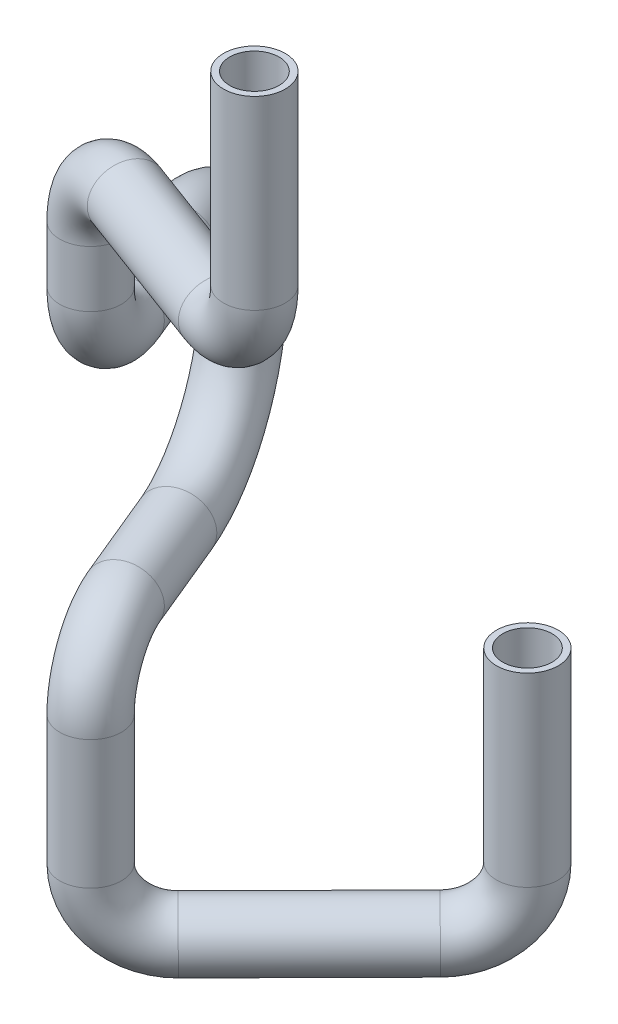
ISO-10303-21;
HEADER;
FILE_DESCRIPTION(('STEP AP214'),'2;1');
FILE_NAME('part.step','',(''),(''),'','','');
FILE_SCHEMA(('AUTOMOTIVE_DESIGN { 1 0 10303 214 1 1 1 1 }'));
ENDSEC;
DATA;
#1=APPLICATION_CONTEXT('core data for automotive mechanical design processes');
#2=APPLICATION_PROTOCOL_DEFINITION('international standard','automotive_design',2000,#1);
#3=PRODUCT_CONTEXT('',#1,'mechanical');
#4=PRODUCT('Part','Part','',(#3));
#5=PRODUCT_RELATED_PRODUCT_CATEGORY('part','',(#4));
#6=PRODUCT_DEFINITION_FORMATION('','',#4);
#7=PRODUCT_DEFINITION_CONTEXT('part definition',#1,'design');
#8=PRODUCT_DEFINITION('design','',#6,#7);
#9=PRODUCT_DEFINITION_SHAPE('','',#8);
#10=(LENGTH_UNIT() NAMED_UNIT(*) SI_UNIT(.MILLI.,.METRE.));
#11=(NAMED_UNIT(*) PLANE_ANGLE_UNIT() SI_UNIT($,.RADIAN.));
#12=(NAMED_UNIT(*) SI_UNIT($,.STERADIAN.) SOLID_ANGLE_UNIT());
#13=UNCERTAINTY_MEASURE_WITH_UNIT(LENGTH_MEASURE(1.E-05),#10,'distance_accuracy_value','');
#14=(GEOMETRIC_REPRESENTATION_CONTEXT(3) GLOBAL_UNCERTAINTY_ASSIGNED_CONTEXT((#13)) GLOBAL_UNIT_ASSIGNED_CONTEXT((#10,
#11,#12)) REPRESENTATION_CONTEXT('',''));
#15=CARTESIAN_POINT('',(0.,0.,0.));
#16=DIRECTION('',(0.,0.,1.));
#17=DIRECTION('',(1.,0.,0.));
#18=AXIS2_PLACEMENT_3D('',#15,#16,#17);
#19=CARTESIAN_POINT('',(-6.85989280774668,-139.849267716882,6.8598928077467));
#20=DIRECTION('',(0.,1.,0.));
#21=DIRECTION('',(0.,0.,1.));
#22=AXIS2_PLACEMENT_3D('',#19,#20,#21);
#23=CYLINDRICAL_SURFACE('',#22,5.);
#24=CARTESIAN_POINT('',(-6.85989280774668,-139.849267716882,6.8598928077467));
#25=DIRECTION('',(0.,-1.,0.));
#26=DIRECTION('',(1.,0.,0.));
#27=AXIS2_PLACEMENT_3D('',#24,#25,#26);
#28=CIRCLE('',#27,5.);
#29=CARTESIAN_POINT('',(-3.32435890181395,-139.849267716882,3.32435890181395));
#30=VERTEX_POINT('',#29);
#31=EDGE_CURVE('E41',#30,#30,#28,.T.);
#32=ORIENTED_EDGE('',*,*,#31,.F.);
#33=EDGE_LOOP('',(#32));
#34=FACE_BOUND('',#33,.T.);
#35=CARTESIAN_POINT('',(-6.85989280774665,-109.811672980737,6.85989280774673));
#36=DIRECTION('',(0.,-1.,0.));
#37=DIRECTION('',(1.,0.,0.));
#38=AXIS2_PLACEMENT_3D('',#35,#36,#37);
#39=CIRCLE('',#38,5.);
#40=CARTESIAN_POINT('',(-1.85989280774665,-109.811672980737,6.8598928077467));
#41=VERTEX_POINT('',#40);
#42=EDGE_CURVE('E10',#41,#41,#39,.T.);
#43=ORIENTED_EDGE('',*,*,#42,.T.);
#44=EDGE_LOOP('',(#43));
#45=FACE_BOUND('',#44,.T.);
#46=ADVANCED_FACE('F31',(#34,#45),#23,.T.);
#47=CARTESIAN_POINT('',(-6.85989280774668,-139.849267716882,6.8598928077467));
#48=DIRECTION('',(0.,1.,0.));
#49=DIRECTION('',(0.,0.,1.));
#50=AXIS2_PLACEMENT_3D('',#47,#48,#49);
#51=CYLINDRICAL_SURFACE('',#50,4.);
#52=CARTESIAN_POINT('',(-6.85989280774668,-139.849267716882,6.8598928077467));
#53=DIRECTION('',(0.,-1.,0.));
#54=DIRECTION('',(1.,0.,0.));
#55=AXIS2_PLACEMENT_3D('',#52,#53,#54);
#56=CIRCLE('',#55,4.);
#57=CARTESIAN_POINT('',(-4.03146568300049,-139.849267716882,4.03146568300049));
#58=VERTEX_POINT('',#57);
#59=EDGE_CURVE('E45',#58,#58,#56,.T.);
#60=ORIENTED_EDGE('',*,*,#59,.T.);
#61=EDGE_LOOP('',(#60));
#62=FACE_BOUND('',#61,.T.);
#63=CARTESIAN_POINT('',(-6.85989280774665,-109.811672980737,6.85989280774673));
#64=DIRECTION('',(0.,-1.,0.));
#65=DIRECTION('',(1.,0.,0.));
#66=AXIS2_PLACEMENT_3D('',#63,#64,#65);
#67=CIRCLE('',#66,4.);
#68=CARTESIAN_POINT('',(-2.85989280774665,-109.811672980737,6.8598928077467));
#69=VERTEX_POINT('',#68);
#70=EDGE_CURVE('E37',#69,#69,#67,.T.);
#71=ORIENTED_EDGE('',*,*,#70,.F.);
#72=EDGE_LOOP('',(#71));
#73=FACE_BOUND('',#72,.T.);
#74=ADVANCED_FACE('F160',(#62,#73),#51,.F.);
#75=CARTESIAN_POINT('',(-13.9309606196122,-139.849267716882,13.9309606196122));
#76=DIRECTION('',(0.707106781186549,0.,0.707106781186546));
#77=DIRECTION('',(0.707106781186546,0.,-0.707106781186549));
#78=AXIS2_PLACEMENT_3D('',#75,#76,#77);
#79=TOROIDAL_SURFACE('',#78,10.,5.);
#80=CARTESIAN_POINT('',(-13.9043271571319,-149.849196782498,13.904327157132));
#81=DIRECTION('',(-0.707101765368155,-0.00376654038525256,0.707101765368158));
#82=DIRECTION('',(0.501883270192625,-0.707101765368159,0.498116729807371));
#83=AXIS2_PLACEMENT_3D('',#80,#81,#82);
#84=CIRCLE('',#83,5.);
#85=CARTESIAN_POINT('',(-13.8910104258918,-154.849161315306,13.8910104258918));
#86=VERTEX_POINT('',#85);
#87=EDGE_CURVE('E50',#86,#86,#84,.T.);
#88=CARTESIAN_POINT('',(-13.9309606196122,-139.849267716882,13.9309606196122));
#89=DIRECTION('',(0.707106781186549,0.,0.707106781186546));
#90=DIRECTION('',(0.707106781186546,0.,-0.707106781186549));
#91=AXIS2_PLACEMENT_3D('',#88,#89,#90);
#92=CIRCLE('',#91,15.);
#93=EDGE_CURVE('',#86,#30,#92,.T.);
#94=ORIENTED_EDGE('',*,*,#87,.F.);
#95=ORIENTED_EDGE('',*,*,#31,.T.);
#96=ORIENTED_EDGE('',*,*,#93,.T.);
#97=ORIENTED_EDGE('',*,*,#93,.F.);
#98=EDGE_LOOP('',(#94,#96,#95,#97));
#99=FACE_BOUND('',#98,.T.);
#100=ADVANCED_FACE('F165',(#99),#79,.T.);
#101=CARTESIAN_POINT('',(-13.9309606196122,-139.849267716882,13.9309606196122));
#102=DIRECTION('',(0.707106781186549,0.,0.707106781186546));
#103=DIRECTION('',(0.707106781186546,0.,-0.707106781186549));
#104=AXIS2_PLACEMENT_3D('',#101,#102,#103);
#105=TOROIDAL_SURFACE('',#104,10.,4.);
#106=CARTESIAN_POINT('',(-13.9043271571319,-149.849196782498,13.904327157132));
#107=DIRECTION('',(-0.707101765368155,-0.00376654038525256,0.707101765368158));
#108=DIRECTION('',(0.501883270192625,-0.707101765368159,0.498116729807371));
#109=AXIS2_PLACEMENT_3D('',#106,#107,#108);
#110=CIRCLE('',#109,4.);
#111=CARTESIAN_POINT('',(-13.8936737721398,-153.849168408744,13.8936737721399));
#112=VERTEX_POINT('',#111);
#113=EDGE_CURVE('E53',#112,#112,#110,.T.);
#114=CARTESIAN_POINT('',(-13.9309606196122,-139.849267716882,13.9309606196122));
#115=DIRECTION('',(0.707106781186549,0.,0.707106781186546));
#116=DIRECTION('',(0.707106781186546,0.,-0.707106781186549));
#117=AXIS2_PLACEMENT_3D('',#114,#115,#116);
#118=CIRCLE('',#117,14.);
#119=EDGE_CURVE('',#112,#58,#118,.T.);
#120=ORIENTED_EDGE('',*,*,#113,.T.);
#121=ORIENTED_EDGE('',*,*,#59,.F.);
#122=ORIENTED_EDGE('',*,*,#119,.T.);
#123=ORIENTED_EDGE('',*,*,#119,.F.);
#124=EDGE_LOOP('',(#120,#122,#121,#123));
#125=FACE_BOUND('',#124,.T.);
#126=ADVANCED_FACE('F170',(#125),#105,.F.);
#127=CARTESIAN_POINT('',(-35.1172798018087,-149.962192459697,35.1172798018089));
#128=DIRECTION('',(0.707101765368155,0.00376654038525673,-0.707101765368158));
#129=DIRECTION('',(-0.707106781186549,0.,-0.707106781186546));
#130=AXIS2_PLACEMENT_3D('',#127,#128,#129);
#131=CYLINDRICAL_SURFACE('',#130,5.);
#132=CARTESIAN_POINT('',(-35.1172798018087,-149.962192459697,35.1172798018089));
#133=DIRECTION('',(-0.707101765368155,-0.00376654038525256,0.707101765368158));
#134=DIRECTION('',(0.501883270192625,-0.707101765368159,0.498116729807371));
#135=AXIS2_PLACEMENT_3D('',#132,#133,#134);
#136=CIRCLE('',#135,5.);
#137=CARTESIAN_POINT('',(-35.1039630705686,-154.962156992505,35.1039630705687));
#138=VERTEX_POINT('',#137);
#139=EDGE_CURVE('E56',#138,#138,#136,.T.);
#140=ORIENTED_EDGE('',*,*,#139,.F.);
#141=EDGE_LOOP('',(#140));
#142=FACE_BOUND('',#141,.T.);
#143=ORIENTED_EDGE('',*,*,#87,.T.);
#144=EDGE_LOOP('',(#143));
#145=FACE_BOUND('',#144,.T.);
#146=ADVANCED_FACE('F176',(#142,#145),#131,.T.);
#147=CARTESIAN_POINT('',(-35.1172798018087,-149.962192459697,35.1172798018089));
#148=DIRECTION('',(0.707101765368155,0.00376654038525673,-0.707101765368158));
#149=DIRECTION('',(-0.707106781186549,0.,-0.707106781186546));
#150=AXIS2_PLACEMENT_3D('',#147,#148,#149);
#151=CYLINDRICAL_SURFACE('',#150,4.);
#152=CARTESIAN_POINT('',(-35.1172798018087,-149.962192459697,35.1172798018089));
#153=DIRECTION('',(-0.707101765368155,-0.00376654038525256,0.707101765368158));
#154=DIRECTION('',(0.501883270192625,-0.707101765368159,0.498116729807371));
#155=AXIS2_PLACEMENT_3D('',#152,#153,#154);
#156=CIRCLE('',#155,4.);
#157=CARTESIAN_POINT('',(-35.1066264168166,-153.962164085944,35.1066264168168));
#158=VERTEX_POINT('',#157);
#159=EDGE_CURVE('E59',#158,#158,#156,.T.);
#160=ORIENTED_EDGE('',*,*,#159,.T.);
#161=EDGE_LOOP('',(#160));
#162=FACE_BOUND('',#161,.T.);
#163=ORIENTED_EDGE('',*,*,#113,.F.);
#164=EDGE_LOOP('',(#163));
#165=FACE_BOUND('',#164,.T.);
#166=ADVANCED_FACE('F183',(#162,#165),#151,.F.);
#167=CARTESIAN_POINT('',(-35.143913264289,-139.962263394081,35.1439132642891));
#168=DIRECTION('',(0.707106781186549,0.,0.707106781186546));
#169=DIRECTION('',(0.707106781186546,0.,-0.707106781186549));
#170=AXIS2_PLACEMENT_3D('',#167,#168,#169);
#171=TOROIDAL_SURFACE('',#170,10.,5.);
#172=CARTESIAN_POINT('',(-42.2149810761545,-139.962263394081,42.2149810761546));
#173=DIRECTION('',(0.,1.,0.));
#174=DIRECTION('',(0.,0.,1.));
#175=AXIS2_PLACEMENT_3D('',#172,#173,#174);
#176=CIRCLE('',#175,5.);
#177=CARTESIAN_POINT('',(-45.7505149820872,-139.962263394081,45.7505149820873));
#178=VERTEX_POINT('',#177);
#179=EDGE_CURVE('E62',#178,#178,#176,.T.);
#180=CARTESIAN_POINT('',(-35.143913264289,-139.962263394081,35.1439132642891));
#181=DIRECTION('',(0.707106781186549,0.,0.707106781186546));
#182=DIRECTION('',(0.707106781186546,0.,-0.707106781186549));
#183=AXIS2_PLACEMENT_3D('',#180,#181,#182);
#184=CIRCLE('',#183,15.);
#185=EDGE_CURVE('',#178,#138,#184,.T.);
#186=ORIENTED_EDGE('',*,*,#179,.F.);
#187=ORIENTED_EDGE('',*,*,#139,.T.);
#188=ORIENTED_EDGE('',*,*,#185,.T.);
#189=ORIENTED_EDGE('',*,*,#185,.F.);
#190=EDGE_LOOP('',(#186,#188,#187,#189));
#191=FACE_BOUND('',#190,.T.);
#192=ADVANCED_FACE('F187',(#191),#171,.T.);
#193=CARTESIAN_POINT('',(-35.143913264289,-139.962263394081,35.1439132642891));
#194=DIRECTION('',(0.707106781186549,0.,0.707106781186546));
#195=DIRECTION('',(0.707106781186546,0.,-0.707106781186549));
#196=AXIS2_PLACEMENT_3D('',#193,#194,#195);
#197=TOROIDAL_SURFACE('',#196,10.,4.);
#198=CARTESIAN_POINT('',(-42.2149810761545,-139.962263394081,42.2149810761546));
#199=DIRECTION('',(0.,1.,0.));
#200=DIRECTION('',(0.,0.,1.));
#201=AXIS2_PLACEMENT_3D('',#198,#199,#200);
#202=CIRCLE('',#201,4.);
#203=CARTESIAN_POINT('',(-45.0434082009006,-139.962263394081,45.0434082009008));
#204=VERTEX_POINT('',#203);
#205=EDGE_CURVE('E65',#204,#204,#202,.T.);
#206=CARTESIAN_POINT('',(-35.143913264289,-139.962263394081,35.1439132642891));
#207=DIRECTION('',(0.707106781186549,0.,0.707106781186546));
#208=DIRECTION('',(0.707106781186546,0.,-0.707106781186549));
#209=AXIS2_PLACEMENT_3D('',#206,#207,#208);
#210=CIRCLE('',#209,14.);
#211=EDGE_CURVE('',#204,#158,#210,.T.);
#212=ORIENTED_EDGE('',*,*,#205,.T.);
#213=ORIENTED_EDGE('',*,*,#159,.F.);
#214=ORIENTED_EDGE('',*,*,#211,.T.);
#215=ORIENTED_EDGE('',*,*,#211,.F.);
#216=EDGE_LOOP('',(#212,#214,#213,#215));
#217=FACE_BOUND('',#216,.T.);
#218=ADVANCED_FACE('F191',(#217),#197,.F.);
#219=CARTESIAN_POINT('',(-42.2149810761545,-119.135160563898,42.2149810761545));
#220=DIRECTION('',(0.,-1.,0.));
#221=DIRECTION('',(1.,0.,0.));
#222=AXIS2_PLACEMENT_3D('',#219,#220,#221);
#223=CYLINDRICAL_SURFACE('',#222,5.);
#224=CARTESIAN_POINT('',(-42.2149810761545,-119.135160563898,42.2149810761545));
#225=DIRECTION('',(0.,1.,0.));
#226=DIRECTION('',(0.,0.,1.));
#227=AXIS2_PLACEMENT_3D('',#224,#225,#226);
#228=CIRCLE('',#227,5.);
#229=CARTESIAN_POINT('',(-40.3015639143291,-119.135160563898,46.834378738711));
#230=VERTEX_POINT('',#229);
#231=EDGE_CURVE('E68',#230,#230,#228,.T.);
#232=ORIENTED_EDGE('',*,*,#231,.F.);
#233=EDGE_LOOP('',(#232));
#234=FACE_BOUND('',#233,.T.);
#235=ORIENTED_EDGE('',*,*,#179,.T.);
#236=EDGE_LOOP('',(#235));
#237=FACE_BOUND('',#236,.T.);
#238=ADVANCED_FACE('F195',(#234,#237),#223,.T.);
#239=CARTESIAN_POINT('',(-42.2149810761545,-119.135160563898,42.2149810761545));
#240=DIRECTION('',(0.,-1.,0.));
#241=DIRECTION('',(1.,0.,0.));
#242=AXIS2_PLACEMENT_3D('',#239,#240,#241);
#243=CYLINDRICAL_SURFACE('',#242,4.);
#244=CARTESIAN_POINT('',(-42.2149810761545,-119.135160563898,42.2149810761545));
#245=DIRECTION('',(0.,1.,0.));
#246=DIRECTION('',(0.,0.,1.));
#247=AXIS2_PLACEMENT_3D('',#244,#245,#246);
#248=CIRCLE('',#247,4.);
#249=CARTESIAN_POINT('',(-40.6842473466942,-119.135160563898,45.9104992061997));
#250=VERTEX_POINT('',#249);
#251=EDGE_CURVE('E71',#250,#250,#248,.T.);
#252=ORIENTED_EDGE('',*,*,#251,.T.);
#253=EDGE_LOOP('',(#252));
#254=FACE_BOUND('',#253,.T.);
#255=ORIENTED_EDGE('',*,*,#205,.F.);
#256=EDGE_LOOP('',(#255));
#257=FACE_BOUND('',#256,.T.);
#258=ADVANCED_FACE('F199',(#254,#257),#243,.F.);
#259=CARTESIAN_POINT('',(-46.0418153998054,-119.135160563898,32.9761857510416));
#260=DIRECTION('',(0.923879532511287,0.,-0.382683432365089));
#261=DIRECTION('',(-0.382683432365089,0.,-0.923879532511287));
#262=AXIS2_PLACEMENT_3D('',#259,#260,#261);
#263=TOROIDAL_SURFACE('',#262,10.,5.);
#264=CARTESIAN_POINT('',(-46.0418153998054,-109.135160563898,32.9761857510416));
#265=DIRECTION('',(-0.382683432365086,0.,-0.923879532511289));
#266=DIRECTION('',(-0.353553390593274,0.923879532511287,0.146446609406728));
#267=AXIS2_PLACEMENT_3D('',#264,#265,#266);
#268=CIRCLE('',#267,5.);
#269=CARTESIAN_POINT('',(-46.0418153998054,-104.135160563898,32.9761857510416));
#270=VERTEX_POINT('',#269);
#271=EDGE_CURVE('E74',#270,#270,#268,.T.);
#272=CARTESIAN_POINT('',(-46.0418153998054,-119.135160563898,32.9761857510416));
#273=DIRECTION('',(0.923879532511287,0.,-0.382683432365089));
#274=DIRECTION('',(-0.382683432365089,0.,-0.923879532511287));
#275=AXIS2_PLACEMENT_3D('',#272,#273,#274);
#276=CIRCLE('',#275,15.);
#277=EDGE_CURVE('',#270,#230,#276,.T.);
#278=ORIENTED_EDGE('',*,*,#271,.F.);
#279=ORIENTED_EDGE('',*,*,#231,.T.);
#280=ORIENTED_EDGE('',*,*,#277,.T.);
#281=ORIENTED_EDGE('',*,*,#277,.F.);
#282=EDGE_LOOP('',(#278,#280,#279,#281));
#283=FACE_BOUND('',#282,.T.);
#284=ADVANCED_FACE('F203',(#283),#263,.T.);
#285=CARTESIAN_POINT('',(-46.0418153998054,-119.135160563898,32.9761857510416));
#286=DIRECTION('',(0.923879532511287,0.,-0.382683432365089));
#287=DIRECTION('',(-0.382683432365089,0.,-0.923879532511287));
#288=AXIS2_PLACEMENT_3D('',#285,#286,#287);
#289=TOROIDAL_SURFACE('',#288,10.,4.);
#290=CARTESIAN_POINT('',(-46.0418153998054,-109.135160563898,32.9761857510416));
#291=DIRECTION('',(-0.382683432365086,0.,-0.923879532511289));
#292=DIRECTION('',(-0.353553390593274,0.923879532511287,0.146446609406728));
#293=AXIS2_PLACEMENT_3D('',#290,#291,#292);
#294=CIRCLE('',#293,4.);
#295=CARTESIAN_POINT('',(-46.0418153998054,-105.135160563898,32.9761857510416));
#296=VERTEX_POINT('',#295);
#297=EDGE_CURVE('E77',#296,#296,#294,.T.);
#298=CARTESIAN_POINT('',(-46.0418153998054,-119.135160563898,32.9761857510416));
#299=DIRECTION('',(0.923879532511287,0.,-0.382683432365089));
#300=DIRECTION('',(-0.382683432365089,0.,-0.923879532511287));
#301=AXIS2_PLACEMENT_3D('',#298,#299,#300);
#302=CIRCLE('',#301,14.);
#303=EDGE_CURVE('',#296,#250,#302,.T.);
#304=ORIENTED_EDGE('',*,*,#297,.T.);
#305=ORIENTED_EDGE('',*,*,#251,.F.);
#306=ORIENTED_EDGE('',*,*,#303,.T.);
#307=ORIENTED_EDGE('',*,*,#303,.F.);
#308=EDGE_LOOP('',(#304,#306,#305,#307));
#309=FACE_BOUND('',#308,.T.);
#310=ADVANCED_FACE('F207',(#309),#289,.F.);
#311=CARTESIAN_POINT('',(-52.0473301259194,-109.135160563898,18.4775906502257));
#312=DIRECTION('',(0.382683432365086,0.,0.923879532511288));
#313=DIRECTION('',(0.923879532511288,0.,-0.382683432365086));
#314=AXIS2_PLACEMENT_3D('',#311,#312,#313);
#315=CYLINDRICAL_SURFACE('',#314,5.);
#316=CARTESIAN_POINT('',(-52.0473301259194,-109.135160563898,18.4775906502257));
#317=DIRECTION('',(-0.382683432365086,0.,-0.923879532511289));
#318=DIRECTION('',(-0.353553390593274,0.923879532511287,0.146446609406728));
#319=AXIS2_PLACEMENT_3D('',#316,#317,#318);
#320=CIRCLE('',#319,5.);
#321=CARTESIAN_POINT('',(-52.0473301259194,-114.135160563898,18.4775906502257));
#322=VERTEX_POINT('',#321);
#323=EDGE_CURVE('E80',#322,#322,#320,.T.);
#324=ORIENTED_EDGE('',*,*,#323,.F.);
#325=EDGE_LOOP('',(#324));
#326=FACE_BOUND('',#325,.T.);
#327=ORIENTED_EDGE('',*,*,#271,.T.);
#328=EDGE_LOOP('',(#327));
#329=FACE_BOUND('',#328,.T.);
#330=ADVANCED_FACE('F211',(#326,#329),#315,.T.);
#331=CARTESIAN_POINT('',(-52.0473301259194,-109.135160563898,18.4775906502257));
#332=DIRECTION('',(0.382683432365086,0.,0.923879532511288));
#333=DIRECTION('',(0.923879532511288,0.,-0.382683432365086));
#334=AXIS2_PLACEMENT_3D('',#331,#332,#333);
#335=CYLINDRICAL_SURFACE('',#334,4.);
#336=CARTESIAN_POINT('',(-52.0473301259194,-109.135160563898,18.4775906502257));
#337=DIRECTION('',(-0.382683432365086,0.,-0.923879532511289));
#338=DIRECTION('',(-0.353553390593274,0.923879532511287,0.146446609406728));
#339=AXIS2_PLACEMENT_3D('',#336,#337,#338);
#340=CIRCLE('',#339,4.);
#341=CARTESIAN_POINT('',(-52.0473301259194,-113.135160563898,18.4775906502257));
#342=VERTEX_POINT('',#341);
#343=EDGE_CURVE('E83',#342,#342,#340,.T.);
#344=ORIENTED_EDGE('',*,*,#343,.T.);
#345=EDGE_LOOP('',(#344));
#346=FACE_BOUND('',#345,.T.);
#347=ORIENTED_EDGE('',*,*,#297,.F.);
#348=EDGE_LOOP('',(#347));
#349=FACE_BOUND('',#348,.T.);
#350=ADVANCED_FACE('F215',(#346,#349),#335,.F.);
#351=CARTESIAN_POINT('',(-52.0473301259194,-89.1351605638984,18.4775906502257));
#352=DIRECTION('',(-0.923879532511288,0.,0.382683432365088));
#353=DIRECTION('',(0.382683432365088,0.,0.923879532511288));
#354=AXIS2_PLACEMENT_3D('',#351,#352,#353);
#355=TOROIDAL_SURFACE('',#354,20.,5.);
#356=CARTESIAN_POINT('',(-52.0473301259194,-69.1351605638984,18.4775906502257));
#357=DIRECTION('',(0.38268343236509,0.,0.923879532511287));
#358=DIRECTION('',(-0.353553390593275,-0.923879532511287,0.146446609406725));
#359=AXIS2_PLACEMENT_3D('',#356,#357,#358);
#360=CIRCLE('',#359,5.);
#361=CARTESIAN_POINT('',(-52.0473301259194,-64.1351605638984,18.4775906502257));
#362=VERTEX_POINT('',#361);
#363=EDGE_CURVE('E86',#362,#362,#360,.T.);
#364=CARTESIAN_POINT('',(-52.0473301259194,-89.1351605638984,18.4775906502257));
#365=DIRECTION('',(-0.923879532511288,0.,0.382683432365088));
#366=DIRECTION('',(0.382683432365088,0.,0.923879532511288));
#367=AXIS2_PLACEMENT_3D('',#364,#365,#366);
#368=CIRCLE('',#367,25.);
#369=EDGE_CURVE('',#362,#322,#368,.T.);
#370=ORIENTED_EDGE('',*,*,#363,.F.);
#371=ORIENTED_EDGE('',*,*,#323,.T.);
#372=ORIENTED_EDGE('',*,*,#369,.T.);
#373=ORIENTED_EDGE('',*,*,#369,.F.);
#374=EDGE_LOOP('',(#370,#372,#371,#373));
#375=FACE_BOUND('',#374,.T.);
#376=ADVANCED_FACE('F219',(#375),#355,.T.);
#377=CARTESIAN_POINT('',(-52.0473301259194,-89.1351605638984,18.4775906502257));
#378=DIRECTION('',(-0.923879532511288,0.,0.382683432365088));
#379=DIRECTION('',(0.382683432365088,0.,0.923879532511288));
#380=AXIS2_PLACEMENT_3D('',#377,#378,#379);
#381=TOROIDAL_SURFACE('',#380,20.,4.);
#382=CARTESIAN_POINT('',(-52.0473301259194,-69.1351605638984,18.4775906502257));
#383=DIRECTION('',(0.38268343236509,0.,0.923879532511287));
#384=DIRECTION('',(-0.353553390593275,-0.923879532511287,0.146446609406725));
#385=AXIS2_PLACEMENT_3D('',#382,#383,#384);
#386=CIRCLE('',#385,4.);
#387=CARTESIAN_POINT('',(-52.0473301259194,-65.1351605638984,18.4775906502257));
#388=VERTEX_POINT('',#387);
#389=EDGE_CURVE('E89',#388,#388,#386,.T.);
#390=CARTESIAN_POINT('',(-52.0473301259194,-89.1351605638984,18.4775906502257));
#391=DIRECTION('',(-0.923879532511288,0.,0.382683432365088));
#392=DIRECTION('',(0.382683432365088,0.,0.923879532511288));
#393=AXIS2_PLACEMENT_3D('',#390,#391,#392);
#394=CIRCLE('',#393,24.);
#395=EDGE_CURVE('',#388,#342,#394,.T.);
#396=ORIENTED_EDGE('',*,*,#389,.T.);
#397=ORIENTED_EDGE('',*,*,#343,.F.);
#398=ORIENTED_EDGE('',*,*,#395,.T.);
#399=ORIENTED_EDGE('',*,*,#395,.F.);
#400=EDGE_LOOP('',(#396,#398,#397,#399));
#401=FACE_BOUND('',#400,.T.);
#402=ADVANCED_FACE('F223',(#401),#381,.F.);
#403=CARTESIAN_POINT('',(-46.0418153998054,-69.1351605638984,32.9761857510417));
#404=DIRECTION('',(-0.382683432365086,0.,-0.923879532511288));
#405=DIRECTION('',(-0.923879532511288,0.,0.382683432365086));
#406=AXIS2_PLACEMENT_3D('',#403,#404,#405);
#407=CYLINDRICAL_SURFACE('',#406,5.);
#408=CARTESIAN_POINT('',(-46.0418153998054,-69.1351605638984,32.9761857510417));
#409=DIRECTION('',(0.38268343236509,0.,0.923879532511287));
#410=DIRECTION('',(-0.353553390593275,-0.923879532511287,0.146446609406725));
#411=AXIS2_PLACEMENT_3D('',#408,#409,#410);
#412=CIRCLE('',#411,5.);
#413=CARTESIAN_POINT('',(-46.0418153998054,-74.1351605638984,32.9761857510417));
#414=VERTEX_POINT('',#413);
#415=EDGE_CURVE('E92',#414,#414,#412,.T.);
#416=ORIENTED_EDGE('',*,*,#415,.F.);
#417=EDGE_LOOP('',(#416));
#418=FACE_BOUND('',#417,.T.);
#419=ORIENTED_EDGE('',*,*,#363,.T.);
#420=EDGE_LOOP('',(#419));
#421=FACE_BOUND('',#420,.T.);
#422=ADVANCED_FACE('F227',(#418,#421),#407,.T.);
#423=CARTESIAN_POINT('',(-46.0418153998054,-69.1351605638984,32.9761857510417));
#424=DIRECTION('',(-0.382683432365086,0.,-0.923879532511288));
#425=DIRECTION('',(-0.923879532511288,0.,0.382683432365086));
#426=AXIS2_PLACEMENT_3D('',#423,#424,#425);
#427=CYLINDRICAL_SURFACE('',#426,4.);
#428=CARTESIAN_POINT('',(-46.0418153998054,-69.1351605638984,32.9761857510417));
#429=DIRECTION('',(0.38268343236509,0.,0.923879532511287));
#430=DIRECTION('',(-0.353553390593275,-0.923879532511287,0.146446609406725));
#431=AXIS2_PLACEMENT_3D('',#428,#429,#430);
#432=CIRCLE('',#431,4.);
#433=CARTESIAN_POINT('',(-46.0418153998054,-73.1351605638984,32.9761857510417));
#434=VERTEX_POINT('',#433);
#435=EDGE_CURVE('E95',#434,#434,#432,.T.);
#436=ORIENTED_EDGE('',*,*,#435,.T.);
#437=EDGE_LOOP('',(#436));
#438=FACE_BOUND('',#437,.T.);
#439=ORIENTED_EDGE('',*,*,#389,.F.);
#440=EDGE_LOOP('',(#439));
#441=FACE_BOUND('',#440,.T.);
#442=ADVANCED_FACE('F231',(#438,#441),#427,.F.);
#443=CARTESIAN_POINT('',(-46.0418153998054,-59.1351605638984,32.9761857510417));
#444=DIRECTION('',(0.923879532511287,0.,-0.38268343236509));
#445=DIRECTION('',(-0.38268343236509,0.,-0.923879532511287));
#446=AXIS2_PLACEMENT_3D('',#443,#444,#445);
#447=TOROIDAL_SURFACE('',#446,10.,5.);
#448=CARTESIAN_POINT('',(-42.2149810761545,-59.1351605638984,42.2149810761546));
#449=DIRECTION('',(0.,1.,0.));
#450=DIRECTION('',(0.,0.,1.));
#451=AXIS2_PLACEMENT_3D('',#448,#449,#450);
#452=CIRCLE('',#451,5.);
#453=CARTESIAN_POINT('',(-40.301563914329,-59.1351605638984,46.834378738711));
#454=VERTEX_POINT('',#453);
#455=EDGE_CURVE('E98',#454,#454,#452,.T.);
#456=CARTESIAN_POINT('',(-46.0418153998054,-59.1351605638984,32.9761857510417));
#457=DIRECTION('',(0.923879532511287,0.,-0.38268343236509));
#458=DIRECTION('',(-0.38268343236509,0.,-0.923879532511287));
#459=AXIS2_PLACEMENT_3D('',#456,#457,#458);
#460=CIRCLE('',#459,15.);
#461=EDGE_CURVE('',#454,#414,#460,.T.);
#462=ORIENTED_EDGE('',*,*,#455,.F.);
#463=ORIENTED_EDGE('',*,*,#415,.T.);
#464=ORIENTED_EDGE('',*,*,#461,.T.);
#465=ORIENTED_EDGE('',*,*,#461,.F.);
#466=EDGE_LOOP('',(#462,#464,#463,#465));
#467=FACE_BOUND('',#466,.T.);
#468=ADVANCED_FACE('F235',(#467),#447,.T.);
#469=CARTESIAN_POINT('',(-46.0418153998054,-59.1351605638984,32.9761857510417));
#470=DIRECTION('',(0.923879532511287,0.,-0.38268343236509));
#471=DIRECTION('',(-0.38268343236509,0.,-0.923879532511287));
#472=AXIS2_PLACEMENT_3D('',#469,#470,#471);
#473=TOROIDAL_SURFACE('',#472,10.,4.);
#474=CARTESIAN_POINT('',(-42.2149810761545,-59.1351605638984,42.2149810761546));
#475=DIRECTION('',(0.,1.,0.));
#476=DIRECTION('',(0.,0.,1.));
#477=AXIS2_PLACEMENT_3D('',#474,#475,#476);
#478=CIRCLE('',#477,4.);
#479=CARTESIAN_POINT('',(-40.6842473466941,-59.1351605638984,45.9104992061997));
#480=VERTEX_POINT('',#479);
#481=EDGE_CURVE('E101',#480,#480,#478,.T.);
#482=CARTESIAN_POINT('',(-46.0418153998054,-59.1351605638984,32.9761857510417));
#483=DIRECTION('',(0.923879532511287,0.,-0.38268343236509));
#484=DIRECTION('',(-0.38268343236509,0.,-0.923879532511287));
#485=AXIS2_PLACEMENT_3D('',#482,#483,#484);
#486=CIRCLE('',#485,14.);
#487=EDGE_CURVE('',#480,#434,#486,.T.);
#488=ORIENTED_EDGE('',*,*,#481,.T.);
#489=ORIENTED_EDGE('',*,*,#435,.F.);
#490=ORIENTED_EDGE('',*,*,#487,.T.);
#491=ORIENTED_EDGE('',*,*,#487,.F.);
#492=EDGE_LOOP('',(#488,#490,#489,#491));
#493=FACE_BOUND('',#492,.T.);
#494=ADVANCED_FACE('F239',(#493),#473,.F.);
#495=CARTESIAN_POINT('',(-42.2149810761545,-50.,42.2149810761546));
#496=DIRECTION('',(0.,-1.,0.));
#497=DIRECTION('',(1.,0.,0.));
#498=AXIS2_PLACEMENT_3D('',#495,#496,#497);
#499=CYLINDRICAL_SURFACE('',#498,5.);
#500=CARTESIAN_POINT('',(-42.2149810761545,-50.,42.2149810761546));
#501=DIRECTION('',(0.,1.,0.));
#502=DIRECTION('',(0.,0.,1.));
#503=AXIS2_PLACEMENT_3D('',#500,#501,#502);
#504=CIRCLE('',#503,5.);
#505=CARTESIAN_POINT('',(-46.9012797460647,-50.,40.4718216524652));
#506=VERTEX_POINT('',#505);
#507=EDGE_CURVE('E104',#506,#506,#504,.T.);
#508=ORIENTED_EDGE('',*,*,#507,.F.);
#509=EDGE_LOOP('',(#508));
#510=FACE_BOUND('',#509,.T.);
#511=ORIENTED_EDGE('',*,*,#455,.T.);
#512=EDGE_LOOP('',(#511));
#513=FACE_BOUND('',#512,.T.);
#514=ADVANCED_FACE('F243',(#510,#513),#499,.T.);
#515=CARTESIAN_POINT('',(-42.2149810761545,-50.,42.2149810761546));
#516=DIRECTION('',(0.,-1.,0.));
#517=DIRECTION('',(1.,0.,0.));
#518=AXIS2_PLACEMENT_3D('',#515,#516,#517);
#519=CYLINDRICAL_SURFACE('',#518,4.);
#520=CARTESIAN_POINT('',(-42.2149810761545,-50.,42.2149810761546));
#521=DIRECTION('',(0.,1.,0.));
#522=DIRECTION('',(0.,0.,1.));
#523=AXIS2_PLACEMENT_3D('',#520,#521,#522);
#524=CIRCLE('',#523,4.);
#525=CARTESIAN_POINT('',(-45.9640200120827,-50.,40.8204535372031));
#526=VERTEX_POINT('',#525);
#527=EDGE_CURVE('E107',#526,#526,#524,.T.);
#528=ORIENTED_EDGE('',*,*,#527,.T.);
#529=EDGE_LOOP('',(#528));
#530=FACE_BOUND('',#529,.T.);
#531=ORIENTED_EDGE('',*,*,#481,.F.);
#532=EDGE_LOOP('',(#531));
#533=FACE_BOUND('',#532,.T.);
#534=ADVANCED_FACE('F247',(#530,#533),#519,.F.);
#535=CARTESIAN_POINT('',(-32.8423837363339,-50.,45.7012999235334));
#536=DIRECTION('',(-0.34863188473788,0.,0.937259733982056));
#537=DIRECTION('',(0.937259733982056,0.,0.34863188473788));
#538=AXIS2_PLACEMENT_3D('',#535,#536,#537);
#539=TOROIDAL_SURFACE('',#538,10.,5.);
#540=CARTESIAN_POINT('',(-32.8423837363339,-40.,45.7012999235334));
#541=DIRECTION('',(0.937259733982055,0.,0.348631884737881));
#542=DIRECTION('',(-0.326758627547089,-0.34863188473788,0.878455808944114));
#543=AXIS2_PLACEMENT_3D('',#540,#541,#542);
#544=CIRCLE('',#543,5.);
#545=CARTESIAN_POINT('',(-32.8423837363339,-35.,45.7012999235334));
#546=VERTEX_POINT('',#545);
#547=EDGE_CURVE('E110',#546,#546,#544,.T.);
#548=CARTESIAN_POINT('',(-32.8423837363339,-50.,45.7012999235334));
#549=DIRECTION('',(-0.34863188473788,0.,0.937259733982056));
#550=DIRECTION('',(0.937259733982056,0.,0.34863188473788));
#551=AXIS2_PLACEMENT_3D('',#548,#549,#550);
#552=CIRCLE('',#551,15.);
#553=EDGE_CURVE('',#546,#506,#552,.T.);
#554=ORIENTED_EDGE('',*,*,#547,.F.);
#555=ORIENTED_EDGE('',*,*,#507,.T.);
#556=ORIENTED_EDGE('',*,*,#553,.T.);
#557=ORIENTED_EDGE('',*,*,#553,.F.);
#558=EDGE_LOOP('',(#554,#556,#555,#557));
#559=FACE_BOUND('',#558,.T.);
#560=ADVANCED_FACE('F251',(#559),#539,.T.);
#561=CARTESIAN_POINT('',(-32.8423837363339,-50.,45.7012999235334));
#562=DIRECTION('',(-0.34863188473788,0.,0.937259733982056));
#563=DIRECTION('',(0.937259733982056,0.,0.34863188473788));
#564=AXIS2_PLACEMENT_3D('',#561,#562,#563);
#565=TOROIDAL_SURFACE('',#564,10.,4.);
#566=CARTESIAN_POINT('',(-32.8423837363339,-40.,45.7012999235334));
#567=DIRECTION('',(0.937259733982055,0.,0.348631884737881));
#568=DIRECTION('',(-0.326758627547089,-0.34863188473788,0.878455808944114));
#569=AXIS2_PLACEMENT_3D('',#566,#567,#568);
#570=CIRCLE('',#569,4.);
#571=CARTESIAN_POINT('',(-32.8423837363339,-36.,45.7012999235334));
#572=VERTEX_POINT('',#571);
#573=EDGE_CURVE('E113',#572,#572,#570,.T.);
#574=CARTESIAN_POINT('',(-32.8423837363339,-50.,45.7012999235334));
#575=DIRECTION('',(-0.34863188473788,0.,0.937259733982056));
#576=DIRECTION('',(0.937259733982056,0.,0.34863188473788));
#577=AXIS2_PLACEMENT_3D('',#574,#575,#576);
#578=CIRCLE('',#577,14.);
#579=EDGE_CURVE('',#572,#526,#578,.T.);
#580=ORIENTED_EDGE('',*,*,#573,.T.);
#581=ORIENTED_EDGE('',*,*,#527,.F.);
#582=ORIENTED_EDGE('',*,*,#579,.T.);
#583=ORIENTED_EDGE('',*,*,#579,.F.);
#584=EDGE_LOOP('',(#580,#582,#581,#583));
#585=FACE_BOUND('',#584,.T.);
#586=ADVANCED_FACE('F255',(#585),#565,.F.);
#587=CARTESIAN_POINT('',(-9.37259733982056,-40.,54.4313408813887));
#588=DIRECTION('',(-0.937259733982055,0.,-0.348631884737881));
#589=DIRECTION('',(-0.348631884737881,0.,0.937259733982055));
#590=AXIS2_PLACEMENT_3D('',#587,#588,#589);
#591=CYLINDRICAL_SURFACE('',#590,5.);
#592=CARTESIAN_POINT('',(-9.37259733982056,-40.,54.4313408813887));
#593=DIRECTION('',(0.937259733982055,0.,0.348631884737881));
#594=DIRECTION('',(-0.326758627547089,-0.34863188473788,0.878455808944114));
#595=AXIS2_PLACEMENT_3D('',#592,#593,#594);
#596=CIRCLE('',#595,5.);
#597=CARTESIAN_POINT('',(-9.37259733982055,-45.,54.4313408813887));
#598=VERTEX_POINT('',#597);
#599=EDGE_CURVE('E116',#598,#598,#596,.T.);
#600=ORIENTED_EDGE('',*,*,#599,.F.);
#601=EDGE_LOOP('',(#600));
#602=FACE_BOUND('',#601,.T.);
#603=ORIENTED_EDGE('',*,*,#547,.T.);
#604=EDGE_LOOP('',(#603));
#605=FACE_BOUND('',#604,.T.);
#606=ADVANCED_FACE('F259',(#602,#605),#591,.T.);
#607=CARTESIAN_POINT('',(-9.37259733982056,-40.,54.4313408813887));
#608=DIRECTION('',(-0.937259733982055,0.,-0.348631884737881));
#609=DIRECTION('',(-0.348631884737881,0.,0.937259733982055));
#610=AXIS2_PLACEMENT_3D('',#607,#608,#609);
#611=CYLINDRICAL_SURFACE('',#610,4.);
#612=CARTESIAN_POINT('',(-9.37259733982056,-40.,54.4313408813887));
#613=DIRECTION('',(0.937259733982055,0.,0.348631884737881));
#614=DIRECTION('',(-0.326758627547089,-0.34863188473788,0.878455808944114));
#615=AXIS2_PLACEMENT_3D('',#612,#613,#614);
#616=CIRCLE('',#615,4.);
#617=CARTESIAN_POINT('',(-9.37259733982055,-44.,54.4313408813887));
#618=VERTEX_POINT('',#617);
#619=EDGE_CURVE('E119',#618,#618,#616,.T.);
#620=ORIENTED_EDGE('',*,*,#619,.T.);
#621=EDGE_LOOP('',(#620));
#622=FACE_BOUND('',#621,.T.);
#623=ORIENTED_EDGE('',*,*,#573,.F.);
#624=EDGE_LOOP('',(#623));
#625=FACE_BOUND('',#624,.T.);
#626=ADVANCED_FACE('F263',(#622,#625),#611,.F.);
#627=CARTESIAN_POINT('',(-9.37259733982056,-30.,54.4313408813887));
#628=DIRECTION('',(0.348631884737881,0.,-0.937259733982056));
#629=DIRECTION('',(-0.937259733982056,0.,-0.348631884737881));
#630=AXIS2_PLACEMENT_3D('',#627,#628,#629);
#631=TOROIDAL_SURFACE('',#630,10.,5.);
#632=CARTESIAN_POINT('',(0.,-30.,57.9176597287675));
#633=DIRECTION('',(0.,1.,0.));
#634=DIRECTION('',(0.,0.,1.));
#635=AXIS2_PLACEMENT_3D('',#632,#633,#634);
#636=CIRCLE('',#635,5.);
#637=CARTESIAN_POINT('',(4.68629866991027,-30.,59.6608191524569));
#638=VERTEX_POINT('',#637);
#639=EDGE_CURVE('E122',#638,#638,#636,.T.);
#640=CARTESIAN_POINT('',(-9.37259733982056,-30.,54.4313408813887));
#641=DIRECTION('',(0.348631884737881,0.,-0.937259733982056));
#642=DIRECTION('',(-0.937259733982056,0.,-0.348631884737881));
#643=AXIS2_PLACEMENT_3D('',#640,#641,#642);
#644=CIRCLE('',#643,15.);
#645=EDGE_CURVE('',#638,#598,#644,.T.);
#646=ORIENTED_EDGE('',*,*,#639,.F.);
#647=ORIENTED_EDGE('',*,*,#599,.T.);
#648=ORIENTED_EDGE('',*,*,#645,.T.);
#649=ORIENTED_EDGE('',*,*,#645,.F.);
#650=EDGE_LOOP('',(#646,#648,#647,#649));
#651=FACE_BOUND('',#650,.T.);
#652=ADVANCED_FACE('F267',(#651),#631,.T.);
#653=CARTESIAN_POINT('',(-9.37259733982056,-30.,54.4313408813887));
#654=DIRECTION('',(0.348631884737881,0.,-0.937259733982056));
#655=DIRECTION('',(-0.937259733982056,0.,-0.348631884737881));
#656=AXIS2_PLACEMENT_3D('',#653,#654,#655);
#657=TOROIDAL_SURFACE('',#656,10.,4.);
#658=CARTESIAN_POINT('',(0.,-30.,57.9176597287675));
#659=DIRECTION('',(0.,1.,0.));
#660=DIRECTION('',(0.,0.,1.));
#661=AXIS2_PLACEMENT_3D('',#658,#659,#660);
#662=CIRCLE('',#661,4.);
#663=CARTESIAN_POINT('',(3.74903893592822,-30.,59.3121872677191));
#664=VERTEX_POINT('',#663);
#665=EDGE_CURVE('E126',#664,#664,#662,.T.);
#666=CARTESIAN_POINT('',(-9.37259733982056,-30.,54.4313408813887));
#667=DIRECTION('',(0.348631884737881,0.,-0.937259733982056));
#668=DIRECTION('',(-0.937259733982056,0.,-0.348631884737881));
#669=AXIS2_PLACEMENT_3D('',#666,#667,#668);
#670=CIRCLE('',#669,14.);
#671=EDGE_CURVE('',#664,#618,#670,.T.);
#672=ORIENTED_EDGE('',*,*,#665,.T.);
#673=ORIENTED_EDGE('',*,*,#619,.F.);
#674=ORIENTED_EDGE('',*,*,#671,.T.);
#675=ORIENTED_EDGE('',*,*,#671,.F.);
#676=EDGE_LOOP('',(#672,#674,#673,#675));
#677=FACE_BOUND('',#676,.T.);
#678=ADVANCED_FACE('F135',(#677),#657,.F.);
#679=CARTESIAN_POINT('',(0.,-30.,57.9176597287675));
#680=DIRECTION('',(0.,1.,0.));
#681=DIRECTION('',(-1.,0.,0.));
#682=AXIS2_PLACEMENT_3D('',#679,#680,#681);
#683=CYLINDRICAL_SURFACE('',#682,4.);
#684=ORIENTED_EDGE('',*,*,#665,.F.);
#685=EDGE_LOOP('',(#684));
#686=FACE_BOUND('',#685,.T.);
#687=CARTESIAN_POINT('',(0.,0.,57.9176597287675));
#688=DIRECTION('',(0.,1.,0.));
#689=DIRECTION('',(0.,0.,1.));
#690=AXIS2_PLACEMENT_3D('',#687,#688,#689);
#691=CIRCLE('',#690,4.);
#692=CARTESIAN_POINT('',(0.,0.,61.9176597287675));
#693=VERTEX_POINT('',#692);
#694=EDGE_CURVE('E127',#693,#693,#691,.T.);
#695=ORIENTED_EDGE('',*,*,#694,.T.);
#696=EDGE_LOOP('',(#695));
#697=FACE_BOUND('',#696,.T.);
#698=ADVANCED_FACE('F138',(#686,#697),#683,.F.);
#699=CARTESIAN_POINT('',(0.,-30.,57.9176597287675));
#700=DIRECTION('',(0.,1.,0.));
#701=DIRECTION('',(-1.,0.,0.));
#702=AXIS2_PLACEMENT_3D('',#699,#700,#701);
#703=CYLINDRICAL_SURFACE('',#702,5.);
#704=ORIENTED_EDGE('',*,*,#639,.T.);
#705=EDGE_LOOP('',(#704));
#706=FACE_BOUND('',#705,.T.);
#707=CARTESIAN_POINT('',(0.,0.,57.9176597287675));
#708=DIRECTION('',(0.,1.,0.));
#709=DIRECTION('',(0.,0.,1.));
#710=AXIS2_PLACEMENT_3D('',#707,#708,#709);
#711=CIRCLE('',#710,5.);
#712=CARTESIAN_POINT('',(0.,0.,62.9176597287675));
#713=VERTEX_POINT('',#712);
#714=EDGE_CURVE('E123',#713,#713,#711,.T.);
#715=ORIENTED_EDGE('',*,*,#714,.F.);
#716=EDGE_LOOP('',(#715));
#717=FACE_BOUND('',#716,.T.);
#718=ADVANCED_FACE('F141',(#706,#717),#703,.T.);
#719=CARTESIAN_POINT('',(-6.85989280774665,-109.811672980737,6.85989280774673));
#720=DIRECTION('',(0.,-1.,0.));
#721=DIRECTION('',(1.,0.,0.));
#722=AXIS2_PLACEMENT_3D('',#719,#720,#721);
#723=PLANE('',#722);
#724=ORIENTED_EDGE('',*,*,#70,.T.);
#725=EDGE_LOOP('',(#724));
#726=FACE_BOUND('',#725,.T.);
#727=ORIENTED_EDGE('',*,*,#42,.F.);
#728=EDGE_LOOP('',(#727));
#729=FACE_BOUND('',#728,.T.);
#730=ADVANCED_FACE('F148',(#726,#729),#723,.F.);
#731=CARTESIAN_POINT('',(0.,0.,57.9176597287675));
#732=DIRECTION('',(0.,1.,0.));
#733=DIRECTION('',(0.,0.,1.));
#734=AXIS2_PLACEMENT_3D('',#731,#732,#733);
#735=PLANE('',#734);
#736=ORIENTED_EDGE('',*,*,#694,.F.);
#737=EDGE_LOOP('',(#736));
#738=FACE_BOUND('',#737,.T.);
#739=ORIENTED_EDGE('',*,*,#714,.T.);
#740=EDGE_LOOP('',(#739));
#741=FACE_BOUND('',#740,.T.);
#742=ADVANCED_FACE('F145',(#738,#741),#735,.T.);
#743=CLOSED_SHELL('',(#46,#74,#100,#126,#146,#166,#192,#218,#238,#258,#284,#310,#330,#350,#376,
#402,#422,#442,#468,#494,#514,#534,#560,#586,#606,#626,#652,#678,#698,#718,#730,#742));
#744=MANIFOLD_SOLID_BREP('B2',#743);
#745=ADVANCED_BREP_SHAPE_REPRESENTATION('',(#18,#744),#14);
#746=SHAPE_DEFINITION_REPRESENTATION(#9,#745);
ENDSEC;
END-ISO-10303-21;
